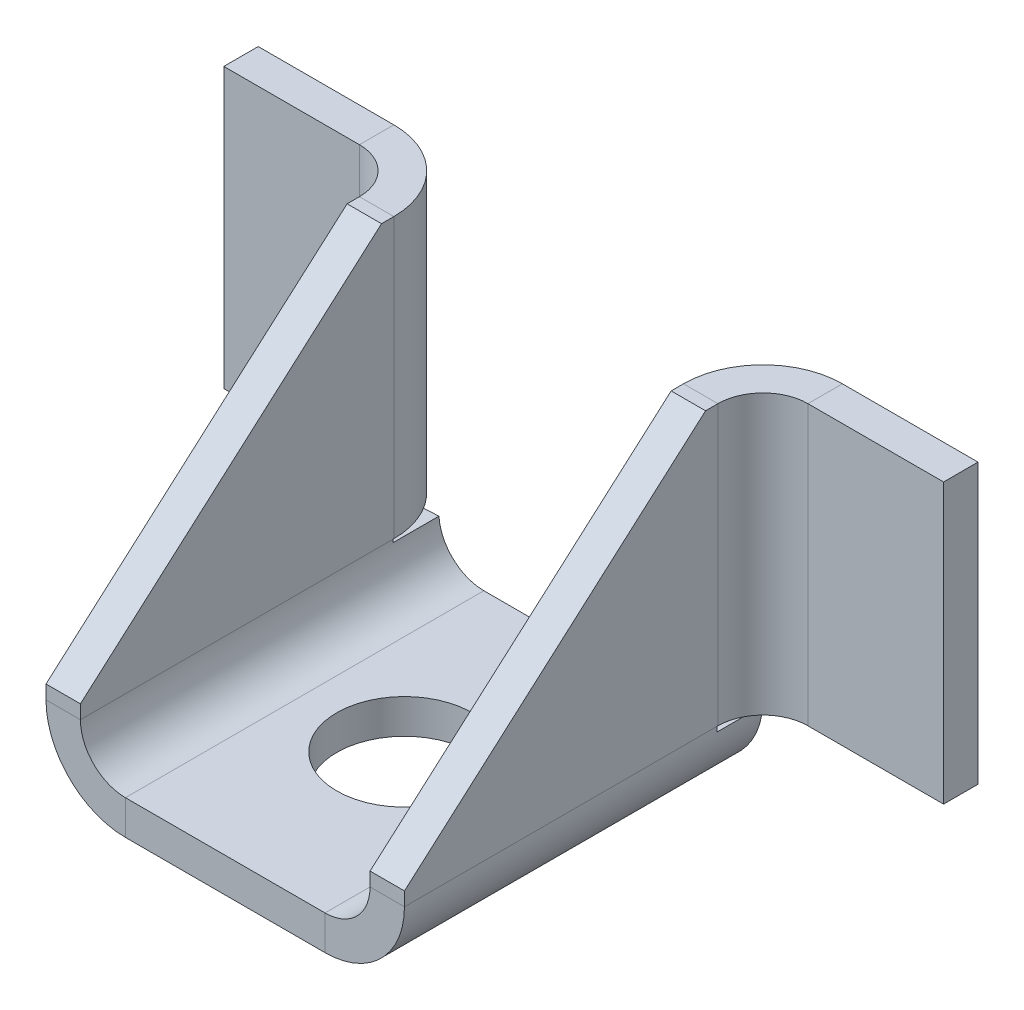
ISO-10303-21;
HEADER;
FILE_DESCRIPTION(('STEP AP214'),'2;1');
FILE_NAME('part.step','',(''),(''),'','','');
FILE_SCHEMA(('AUTOMOTIVE_DESIGN { 1 0 10303 214 1 1 1 1 }'));
ENDSEC;
DATA;
#1=APPLICATION_CONTEXT('core data for automotive mechanical design processes');
#2=APPLICATION_PROTOCOL_DEFINITION('international standard','automotive_design',2000,#1);
#3=PRODUCT_CONTEXT('',#1,'mechanical');
#4=PRODUCT('Part','Part','',(#3));
#5=PRODUCT_RELATED_PRODUCT_CATEGORY('part','',(#4));
#6=PRODUCT_DEFINITION_FORMATION('','',#4);
#7=PRODUCT_DEFINITION_CONTEXT('part definition',#1,'design');
#8=PRODUCT_DEFINITION('design','',#6,#7);
#9=PRODUCT_DEFINITION_SHAPE('','',#8);
#10=(LENGTH_UNIT() NAMED_UNIT(*) SI_UNIT(.MILLI.,.METRE.));
#11=(NAMED_UNIT(*) PLANE_ANGLE_UNIT() SI_UNIT($,.RADIAN.));
#12=(NAMED_UNIT(*) SI_UNIT($,.STERADIAN.) SOLID_ANGLE_UNIT());
#13=UNCERTAINTY_MEASURE_WITH_UNIT(LENGTH_MEASURE(1.E-05),#10,'distance_accuracy_value','');
#14=(GEOMETRIC_REPRESENTATION_CONTEXT(3) GLOBAL_UNCERTAINTY_ASSIGNED_CONTEXT((#13)) GLOBAL_UNIT_ASSIGNED_CONTEXT((#10,
#11,#12)) REPRESENTATION_CONTEXT('',''));
#15=CARTESIAN_POINT('',(0.,0.,0.));
#16=DIRECTION('',(0.,0.,1.));
#17=DIRECTION('',(1.,0.,0.));
#18=AXIS2_PLACEMENT_3D('',#15,#16,#17);
#19=CARTESIAN_POINT('',(-8.83920000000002,3.9878,-15.875));
#20=DIRECTION('',(0.,0.,-1.));
#21=DIRECTION('',(-1.,0.,0.));
#22=AXIS2_PLACEMENT_3D('',#19,#20,#21);
#23=PLANE('',#22);
#24=CARTESIAN_POINT('',(-8.83920000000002,3.9878,-15.875));
#25=DIRECTION('',(0.,0.,1.));
#26=DIRECTION('',(1.,0.,0.));
#27=AXIS2_PLACEMENT_3D('',#24,#25,#26);
#28=CIRCLE('',#27,7.03579999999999);
#29=CARTESIAN_POINT('',(-8.83920000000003,-3.048,-15.875));
#30=VERTEX_POINT('',#29);
#31=CARTESIAN_POINT('',(-15.8607135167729,3.53965987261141,-15.875));
#32=VERTEX_POINT('',#31);
#33=EDGE_CURVE('E324',#30,#32,#28,.F.);
#34=ORIENTED_EDGE('',*,*,#33,.T.);
#35=DIRECTION('',(-0.997969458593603,-0.0636942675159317,0.));
#36=VECTOR('',#35,1.);
#37=CARTESIAN_POINT('',(-15.8607135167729,3.53965987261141,-15.875));
#38=LINE('',#37,#36);
#39=CARTESIAN_POINT('',(-12.8189026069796,3.73379999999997,-15.875));
#40=VERTEX_POINT('',#39);
#41=EDGE_CURVE('E528',#40,#32,#38,.T.);
#42=ORIENTED_EDGE('',*,*,#41,.F.);
#43=CARTESIAN_POINT('',(-8.83920000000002,3.9878,-15.875));
#44=DIRECTION('',(0.,0.,1.));
#45=DIRECTION('',(1.,0.,0.));
#46=AXIS2_PLACEMENT_3D('',#43,#44,#45);
#47=CIRCLE('',#46,3.98779999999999);
#48=CARTESIAN_POINT('',(-8.83920000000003,0.,-15.875));
#49=VERTEX_POINT('',#48);
#50=EDGE_CURVE('E331',#49,#40,#47,.F.);
#51=ORIENTED_EDGE('',*,*,#50,.F.);
#52=DIRECTION('',(0.,-1.,0.));
#53=VECTOR('',#52,1.);
#54=CARTESIAN_POINT('',(-8.83920000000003,0.,-15.875));
#55=LINE('',#54,#53);
#56=EDGE_CURVE('E339',#49,#30,#55,.T.);
#57=ORIENTED_EDGE('',*,*,#56,.T.);
#58=EDGE_LOOP('',(#34,#42,#51,#57));
#59=FACE_BOUND('',#58,.T.);
#60=ADVANCED_FACE('F77',(#59),#23,.T.);
#61=CARTESIAN_POINT('',(-8.83920000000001,3.98780000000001,15.875));
#62=DIRECTION('',(0.,0.,1.));
#63=DIRECTION('',(-1.,0.,0.));
#64=AXIS2_PLACEMENT_3D('',#61,#62,#63);
#65=CYLINDRICAL_SURFACE('',#64,7.03579999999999);
#66=CARTESIAN_POINT('',(-8.83920000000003,3.98780000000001,-11.811));
#67=DIRECTION('',(0.,0.,1.));
#68=DIRECTION('',(1.,0.,0.));
#69=AXIS2_PLACEMENT_3D('',#66,#67,#68);
#70=CIRCLE('',#69,7.0358);
#71=CARTESIAN_POINT('',(-15.875,3.98780000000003,-11.811));
#72=VERTEX_POINT('',#71);
#73=CARTESIAN_POINT('',(-15.8607135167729,3.53965987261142,-11.811));
#74=VERTEX_POINT('',#73);
#75=EDGE_CURVE('E532',#72,#74,#70,.T.);
#76=ORIENTED_EDGE('',*,*,#75,.T.);
#77=DIRECTION('',(0.,0.,-1.));
#78=VECTOR('',#77,1.);
#79=CARTESIAN_POINT('',(-15.8607135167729,3.53965987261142,-11.811));
#80=LINE('',#79,#78);
#81=EDGE_CURVE('E525',#74,#32,#80,.T.);
#82=ORIENTED_EDGE('',*,*,#81,.T.);
#83=ORIENTED_EDGE('',*,*,#33,.F.);
#84=DIRECTION('',(0.,0.,1.));
#85=VECTOR('',#84,1.);
#86=CARTESIAN_POINT('',(-8.83920000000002,-3.04799999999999,15.875));
#87=LINE('',#86,#85);
#88=CARTESIAN_POINT('',(-8.83920000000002,-3.04799999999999,15.875));
#89=VERTEX_POINT('',#88);
#90=EDGE_CURVE('E321',#89,#30,#87,.F.);
#91=ORIENTED_EDGE('',*,*,#90,.F.);
#92=CARTESIAN_POINT('',(-8.83920000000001,3.98780000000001,15.875));
#93=DIRECTION('',(0.,0.,1.));
#94=DIRECTION('',(1.,0.,0.));
#95=AXIS2_PLACEMENT_3D('',#92,#93,#94);
#96=CIRCLE('',#95,7.03579999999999);
#97=CARTESIAN_POINT('',(-15.875,3.98779999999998,15.875));
#98=VERTEX_POINT('',#97);
#99=EDGE_CURVE('E325',#98,#89,#96,.T.);
#100=ORIENTED_EDGE('',*,*,#99,.F.);
#101=DIRECTION('',(0.,0.,1.));
#102=VECTOR('',#101,1.);
#103=CARTESIAN_POINT('',(-15.875,3.98779999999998,-15.875));
#104=LINE('',#103,#102);
#105=EDGE_CURVE('E313',#98,#72,#104,.F.);
#106=ORIENTED_EDGE('',*,*,#105,.T.);
#107=EDGE_LOOP('',(#76,#82,#83,#91,#100,#106));
#108=FACE_BOUND('',#107,.T.);
#109=ADVANCED_FACE('F570',(#108),#65,.T.);
#110=CARTESIAN_POINT('',(-8.83920000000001,3.98780000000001,15.875));
#111=DIRECTION('',(0.,0.,1.));
#112=DIRECTION('',(-1.,0.,0.));
#113=AXIS2_PLACEMENT_3D('',#110,#111,#112);
#114=CYLINDRICAL_SURFACE('',#113,3.98779999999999);
#115=DIRECTION('',(0.,0.,-1.));
#116=VECTOR('',#115,1.);
#117=CARTESIAN_POINT('',(-12.8189026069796,3.73379999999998,32.9882461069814));
#118=LINE('',#117,#116);
#119=CARTESIAN_POINT('',(-12.8189026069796,3.73379999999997,-11.811));
#120=VERTEX_POINT('',#119);
#121=EDGE_CURVE('E530',#120,#40,#118,.T.);
#122=ORIENTED_EDGE('',*,*,#121,.F.);
#123=CARTESIAN_POINT('',(-8.83920000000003,3.98780000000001,-11.811));
#124=DIRECTION('',(0.,0.,-1.));
#125=DIRECTION('',(-1.,0.,0.));
#126=AXIS2_PLACEMENT_3D('',#123,#124,#125);
#127=CIRCLE('',#126,3.9878);
#128=CARTESIAN_POINT('',(-12.827,3.98780000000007,-11.811));
#129=VERTEX_POINT('',#128);
#130=EDGE_CURVE('E537',#129,#120,#127,.F.);
#131=ORIENTED_EDGE('',*,*,#130,.F.);
#132=DIRECTION('',(0.,0.,1.));
#133=VECTOR('',#132,1.);
#134=CARTESIAN_POINT('',(-12.827,3.98779999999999,-15.875));
#135=LINE('',#134,#133);
#136=CARTESIAN_POINT('',(-12.827,3.98779999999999,15.875));
#137=VERTEX_POINT('',#136);
#138=EDGE_CURVE('E299',#129,#137,#135,.T.);
#139=ORIENTED_EDGE('',*,*,#138,.T.);
#140=CARTESIAN_POINT('',(-8.83920000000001,3.98780000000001,15.875));
#141=DIRECTION('',(0.,0.,1.));
#142=DIRECTION('',(1.,0.,0.));
#143=AXIS2_PLACEMENT_3D('',#140,#141,#142);
#144=CIRCLE('',#143,3.98779999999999);
#145=CARTESIAN_POINT('',(-8.83920000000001,0.,15.875));
#146=VERTEX_POINT('',#145);
#147=EDGE_CURVE('E304',#137,#146,#144,.T.);
#148=ORIENTED_EDGE('',*,*,#147,.T.);
#149=DIRECTION('',(0.,0.,1.));
#150=VECTOR('',#149,1.);
#151=CARTESIAN_POINT('',(-8.83920000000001,0.,15.875));
#152=LINE('',#151,#150);
#153=EDGE_CURVE('E334',#146,#49,#152,.F.);
#154=ORIENTED_EDGE('',*,*,#153,.T.);
#155=ORIENTED_EDGE('',*,*,#50,.T.);
#156=EDGE_LOOP('',(#122,#131,#139,#148,#154,#155));
#157=FACE_BOUND('',#156,.T.);
#158=ADVANCED_FACE('F566',(#157),#114,.F.);
#159=CARTESIAN_POINT('',(8.83920000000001,3.9878,-15.875));
#160=DIRECTION('',(0.,0.,1.));
#161=DIRECTION('',(1.,0.,0.));
#162=AXIS2_PLACEMENT_3D('',#159,#160,#161);
#163=PLANE('',#162);
#164=CARTESIAN_POINT('',(8.83920000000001,3.9878,-15.875));
#165=DIRECTION('',(0.,0.,-1.));
#166=DIRECTION('',(-1.,0.,0.));
#167=AXIS2_PLACEMENT_3D('',#164,#165,#166);
#168=CIRCLE('',#167,3.9878);
#169=CARTESIAN_POINT('',(12.8189026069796,3.73379999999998,-15.875));
#170=VERTEX_POINT('',#169);
#171=CARTESIAN_POINT('',(8.83920000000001,0.,-15.875));
#172=VERTEX_POINT('',#171);
#173=EDGE_CURVE('E275',#170,#172,#168,.T.);
#174=ORIENTED_EDGE('',*,*,#173,.F.);
#175=DIRECTION('',(0.997969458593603,-0.0636942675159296,0.));
#176=VECTOR('',#175,1.);
#177=CARTESIAN_POINT('',(15.8607135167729,3.53965987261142,-15.875));
#178=LINE('',#177,#176);
#179=CARTESIAN_POINT('',(15.8607135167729,3.53965987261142,-15.875));
#180=VERTEX_POINT('',#179);
#181=EDGE_CURVE('E261',#170,#180,#178,.T.);
#182=ORIENTED_EDGE('',*,*,#181,.T.);
#183=CARTESIAN_POINT('',(8.83920000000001,3.9878,-15.875));
#184=DIRECTION('',(0.,0.,-1.));
#185=DIRECTION('',(-1.,0.,0.));
#186=AXIS2_PLACEMENT_3D('',#183,#184,#185);
#187=CIRCLE('',#186,7.0358);
#188=CARTESIAN_POINT('',(8.83920000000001,-3.048,-15.875));
#189=VERTEX_POINT('',#188);
#190=EDGE_CURVE('E381',#180,#189,#187,.T.);
#191=ORIENTED_EDGE('',*,*,#190,.T.);
#192=DIRECTION('',(0.,-1.,0.));
#193=VECTOR('',#192,1.);
#194=CARTESIAN_POINT('',(8.83920000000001,0.,-15.875));
#195=LINE('',#194,#193);
#196=EDGE_CURVE('E284',#172,#189,#195,.T.);
#197=ORIENTED_EDGE('',*,*,#196,.F.);
#198=EDGE_LOOP('',(#174,#182,#191,#197));
#199=FACE_BOUND('',#198,.T.);
#200=ADVANCED_FACE('F282',(#199),#163,.F.);
#201=CARTESIAN_POINT('',(8.83920000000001,3.9878,-15.875));
#202=DIRECTION('',(0.,0.,-1.));
#203=DIRECTION('',(1.,0.,0.));
#204=AXIS2_PLACEMENT_3D('',#201,#202,#203);
#205=CYLINDRICAL_SURFACE('',#204,7.0358);
#206=DIRECTION('',(0.,0.,1.));
#207=VECTOR('',#206,1.);
#208=CARTESIAN_POINT('',(15.8607135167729,3.53965987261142,-15.875));
#209=LINE('',#208,#207);
#210=CARTESIAN_POINT('',(15.8607135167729,3.53965987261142,-11.811));
#211=VERTEX_POINT('',#210);
#212=EDGE_CURVE('E267',#180,#211,#209,.T.);
#213=ORIENTED_EDGE('',*,*,#212,.T.);
#214=CARTESIAN_POINT('',(8.83920000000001,3.9878,-11.811));
#215=DIRECTION('',(0.,0.,1.));
#216=DIRECTION('',(1.,0.,0.));
#217=AXIS2_PLACEMENT_3D('',#214,#215,#216);
#218=CIRCLE('',#217,7.0358);
#219=CARTESIAN_POINT('',(15.875,3.9878,-11.811));
#220=VERTEX_POINT('',#219);
#221=EDGE_CURVE('E545',#211,#220,#218,.T.);
#222=ORIENTED_EDGE('',*,*,#221,.T.);
#223=DIRECTION('',(0.,0.,-1.));
#224=VECTOR('',#223,1.);
#225=CARTESIAN_POINT('',(15.875,3.98779999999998,15.875));
#226=LINE('',#225,#224);
#227=CARTESIAN_POINT('',(15.875,3.98779999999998,15.875));
#228=VERTEX_POINT('',#227);
#229=EDGE_CURVE('E398',#220,#228,#226,.F.);
#230=ORIENTED_EDGE('',*,*,#229,.T.);
#231=CARTESIAN_POINT('',(8.83920000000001,3.9878,15.875));
#232=DIRECTION('',(0.,0.,-1.));
#233=DIRECTION('',(-1.,0.,0.));
#234=AXIS2_PLACEMENT_3D('',#231,#232,#233);
#235=CIRCLE('',#234,7.0358);
#236=CARTESIAN_POINT('',(8.83920000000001,-3.048,15.875));
#237=VERTEX_POINT('',#236);
#238=EDGE_CURVE('E301',#237,#228,#235,.F.);
#239=ORIENTED_EDGE('',*,*,#238,.F.);
#240=DIRECTION('',(0.,0.,-1.));
#241=VECTOR('',#240,1.);
#242=CARTESIAN_POINT('',(8.83920000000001,-3.048,-15.875));
#243=LINE('',#242,#241);
#244=EDGE_CURVE('E378',#189,#237,#243,.F.);
#245=ORIENTED_EDGE('',*,*,#244,.F.);
#246=ORIENTED_EDGE('',*,*,#190,.F.);
#247=EDGE_LOOP('',(#213,#222,#230,#239,#245,#246));
#248=FACE_BOUND('',#247,.T.);
#249=ADVANCED_FACE('F557',(#248),#205,.T.);
#250=CARTESIAN_POINT('',(8.83920000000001,3.9878,-15.875));
#251=DIRECTION('',(0.,0.,-1.));
#252=DIRECTION('',(1.,0.,0.));
#253=AXIS2_PLACEMENT_3D('',#250,#251,#252);
#254=CYLINDRICAL_SURFACE('',#253,3.9878);
#255=CARTESIAN_POINT('',(8.83920000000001,3.9878,-11.811));
#256=DIRECTION('',(0.,0.,1.));
#257=DIRECTION('',(1.,0.,0.));
#258=AXIS2_PLACEMENT_3D('',#255,#256,#257);
#259=CIRCLE('',#258,3.9878);
#260=CARTESIAN_POINT('',(12.8189026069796,3.73379999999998,-11.811));
#261=VERTEX_POINT('',#260);
#262=CARTESIAN_POINT('',(12.827,3.98780000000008,-11.811));
#263=VERTEX_POINT('',#262);
#264=EDGE_CURVE('E279',#261,#263,#259,.T.);
#265=ORIENTED_EDGE('',*,*,#264,.F.);
#266=DIRECTION('',(0.,0.,1.));
#267=VECTOR('',#266,1.);
#268=CARTESIAN_POINT('',(12.8189026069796,3.73379999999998,-32.9882461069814));
#269=LINE('',#268,#267);
#270=EDGE_CURVE('E264',#170,#261,#269,.T.);
#271=ORIENTED_EDGE('',*,*,#270,.F.);
#272=ORIENTED_EDGE('',*,*,#173,.T.);
#273=DIRECTION('',(0.,0.,-1.));
#274=VECTOR('',#273,1.);
#275=CARTESIAN_POINT('',(8.83920000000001,0.,-15.875));
#276=LINE('',#275,#274);
#277=CARTESIAN_POINT('',(8.83920000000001,0.,15.875));
#278=VERTEX_POINT('',#277);
#279=EDGE_CURVE('E286',#172,#278,#276,.F.);
#280=ORIENTED_EDGE('',*,*,#279,.T.);
#281=CARTESIAN_POINT('',(8.83920000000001,3.9878,15.875));
#282=DIRECTION('',(0.,0.,-1.));
#283=DIRECTION('',(-1.,0.,0.));
#284=AXIS2_PLACEMENT_3D('',#281,#282,#283);
#285=CIRCLE('',#284,3.9878);
#286=CARTESIAN_POINT('',(12.827,3.98779999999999,15.875));
#287=VERTEX_POINT('',#286);
#288=EDGE_CURVE('E289',#278,#287,#285,.F.);
#289=ORIENTED_EDGE('',*,*,#288,.T.);
#290=DIRECTION('',(0.,0.,-1.));
#291=VECTOR('',#290,1.);
#292=CARTESIAN_POINT('',(12.827,3.98779999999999,15.875));
#293=LINE('',#292,#291);
#294=EDGE_CURVE('E389',#287,#263,#293,.T.);
#295=ORIENTED_EDGE('',*,*,#294,.T.);
#296=EDGE_LOOP('',(#265,#271,#272,#280,#289,#295));
#297=FACE_BOUND('',#296,.T.);
#298=ADVANCED_FACE('F274',(#297),#254,.F.);
#299=CARTESIAN_POINT('',(15.875,0.,0.));
#300=DIRECTION('',(-1.,0.,0.));
#301=DIRECTION('',(0.,-1.,0.));
#302=AXIS2_PLACEMENT_3D('',#299,#300,#301);
#303=PLANE('',#302);
#304=DIRECTION('',(0.,0.,1.));
#305=VECTOR('',#304,1.);
#306=CARTESIAN_POINT('',(15.8750000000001,28.702,0.));
#307=LINE('',#306,#305);
#308=CARTESIAN_POINT('',(15.8750000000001,28.702,-11.8872));
#309=VERTEX_POINT('',#308);
#310=CARTESIAN_POINT('',(15.8750000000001,28.702,-10.795));
#311=VERTEX_POINT('',#310);
#312=EDGE_CURVE('E287',#309,#311,#307,.T.);
#313=ORIENTED_EDGE('',*,*,#312,.T.);
#314=DIRECTION('',(0.,-0.661030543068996,0.750358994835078));
#315=VECTOR('',#314,1.);
#316=CARTESIAN_POINT('',(15.875,10.8059042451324,9.51948707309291));
#317=LINE('',#316,#315);
#318=CARTESIAN_POINT('',(15.8750000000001,5.207,15.875));
#319=VERTEX_POINT('',#318);
#320=EDGE_CURVE('E504',#311,#319,#317,.T.);
#321=ORIENTED_EDGE('',*,*,#320,.T.);
#322=DIRECTION('',(0.,-1.,0.));
#323=VECTOR('',#322,1.);
#324=CARTESIAN_POINT('',(15.875,0.,15.875));
#325=LINE('',#324,#323);
#326=EDGE_CURVE('E292',#319,#228,#325,.T.);
#327=ORIENTED_EDGE('',*,*,#326,.T.);
#328=ORIENTED_EDGE('',*,*,#229,.F.);
#329=CARTESIAN_POINT('',(15.875,3.98780000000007,-11.8872));
#330=VERTEX_POINT('',#329);
#331=EDGE_CURVE('E399',#330,#220,#226,.F.);
#332=ORIENTED_EDGE('',*,*,#331,.F.);
#333=DIRECTION('',(0.,1.,0.));
#334=VECTOR('',#333,1.);
#335=CARTESIAN_POINT('',(15.8750000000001,28.702,-11.8872));
#336=LINE('',#335,#334);
#337=EDGE_CURVE('E464',#309,#330,#336,.F.);
#338=ORIENTED_EDGE('',*,*,#337,.F.);
#339=EDGE_LOOP('',(#313,#321,#327,#328,#332,#338));
#340=FACE_BOUND('',#339,.T.);
#341=ADVANCED_FACE('F564',(#340),#303,.F.);
#342=CARTESIAN_POINT('',(12.827,0.,0.));
#343=DIRECTION('',(-1.,0.,0.));
#344=DIRECTION('',(0.,-1.,0.));
#345=AXIS2_PLACEMENT_3D('',#342,#343,#344);
#346=PLANE('',#345);
#347=DIRECTION('',(0.,-0.661030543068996,0.750358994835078));
#348=VECTOR('',#347,1.);
#349=CARTESIAN_POINT('',(12.827,10.8059042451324,9.5194870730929));
#350=LINE('',#349,#348);
#351=CARTESIAN_POINT('',(12.8270000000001,28.702,-10.795));
#352=VERTEX_POINT('',#351);
#353=CARTESIAN_POINT('',(12.827,5.207,15.875));
#354=VERTEX_POINT('',#353);
#355=EDGE_CURVE('E100',#352,#354,#350,.T.);
#356=ORIENTED_EDGE('',*,*,#355,.F.);
#357=DIRECTION('',(0.,0.,-1.));
#358=VECTOR('',#357,1.);
#359=CARTESIAN_POINT('',(12.8270000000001,28.702,15.875));
#360=LINE('',#359,#358);
#361=CARTESIAN_POINT('',(12.8270000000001,28.702,-11.8872));
#362=VERTEX_POINT('',#361);
#363=EDGE_CURVE('E404',#362,#352,#360,.F.);
#364=ORIENTED_EDGE('',*,*,#363,.F.);
#365=DIRECTION('',(0.,1.,0.));
#366=VECTOR('',#365,1.);
#367=CARTESIAN_POINT('',(12.8270000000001,28.702,-11.8872));
#368=LINE('',#367,#366);
#369=CARTESIAN_POINT('',(12.827,3.98780000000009,-11.8872));
#370=VERTEX_POINT('',#369);
#371=EDGE_CURVE('E474',#362,#370,#368,.F.);
#372=ORIENTED_EDGE('',*,*,#371,.T.);
#373=DIRECTION('',(0.,0.,-1.));
#374=VECTOR('',#373,1.);
#375=CARTESIAN_POINT('',(12.827,3.98780000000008,-15.875));
#376=LINE('',#375,#374);
#377=EDGE_CURVE('E397',#370,#263,#376,.F.);
#378=ORIENTED_EDGE('',*,*,#377,.T.);
#379=ORIENTED_EDGE('',*,*,#294,.F.);
#380=DIRECTION('',(0.,1.,0.));
#381=VECTOR('',#380,1.);
#382=CARTESIAN_POINT('',(12.827,0.,15.875));
#383=LINE('',#382,#381);
#384=EDGE_CURVE('E394',#354,#287,#383,.F.);
#385=ORIENTED_EDGE('',*,*,#384,.F.);
#386=EDGE_LOOP('',(#356,#364,#372,#378,#379,#385));
#387=FACE_BOUND('',#386,.T.);
#388=ADVANCED_FACE('F393',(#387),#346,.T.);
#389=CARTESIAN_POINT('',(15.8750000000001,28.702,15.875));
#390=DIRECTION('',(0.,-1.,0.));
#391=DIRECTION('',(1.,0.,0.));
#392=AXIS2_PLACEMENT_3D('',#389,#390,#391);
#393=PLANE('',#392);
#394=ORIENTED_EDGE('',*,*,#363,.T.);
#395=DIRECTION('',(1.,0.,0.));
#396=VECTOR('',#395,1.);
#397=CARTESIAN_POINT('',(-31.8770000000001,28.702,-10.795));
#398=LINE('',#397,#396);
#399=EDGE_CURVE('E517',#352,#311,#398,.T.);
#400=ORIENTED_EDGE('',*,*,#399,.T.);
#401=ORIENTED_EDGE('',*,*,#312,.F.);
#402=DIRECTION('',(-1.,0.,0.));
#403=VECTOR('',#402,1.);
#404=CARTESIAN_POINT('',(15.8750000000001,28.702,-11.8872));
#405=LINE('',#404,#403);
#406=EDGE_CURVE('E454',#309,#362,#405,.T.);
#407=ORIENTED_EDGE('',*,*,#406,.T.);
#408=EDGE_LOOP('',(#394,#400,#401,#407));
#409=FACE_BOUND('',#408,.T.);
#410=ADVANCED_FACE('F696',(#409),#393,.F.);
#411=CARTESIAN_POINT('',(-15.875,0.,0.));
#412=DIRECTION('',(1.,0.,0.));
#413=DIRECTION('',(0.,1.,0.));
#414=AXIS2_PLACEMENT_3D('',#411,#412,#413);
#415=PLANE('',#414);
#416=DIRECTION('',(0.,1.,0.));
#417=VECTOR('',#416,1.);
#418=CARTESIAN_POINT('',(-15.875,0.,15.875));
#419=LINE('',#418,#417);
#420=CARTESIAN_POINT('',(-15.875,5.207,15.875));
#421=VERTEX_POINT('',#420);
#422=EDGE_CURVE('E305',#98,#421,#419,.T.);
#423=ORIENTED_EDGE('',*,*,#422,.T.);
#424=DIRECTION('',(0.,0.661030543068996,-0.750358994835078));
#425=VECTOR('',#424,1.);
#426=CARTESIAN_POINT('',(-15.875,10.8059042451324,9.51948707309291));
#427=LINE('',#426,#425);
#428=CARTESIAN_POINT('',(-15.8750000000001,28.702,-10.795));
#429=VERTEX_POINT('',#428);
#430=EDGE_CURVE('E92',#421,#429,#427,.T.);
#431=ORIENTED_EDGE('',*,*,#430,.T.);
#432=DIRECTION('',(0.,0.,-1.));
#433=VECTOR('',#432,1.);
#434=CARTESIAN_POINT('',(-15.8750000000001,28.702,0.));
#435=LINE('',#434,#433);
#436=CARTESIAN_POINT('',(-15.8750000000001,28.702,-11.8872));
#437=VERTEX_POINT('',#436);
#438=EDGE_CURVE('E302',#429,#437,#435,.T.);
#439=ORIENTED_EDGE('',*,*,#438,.T.);
#440=DIRECTION('',(0.,-1.,0.));
#441=VECTOR('',#440,1.);
#442=CARTESIAN_POINT('',(-15.875,3.98779999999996,-11.8872));
#443=LINE('',#442,#441);
#444=CARTESIAN_POINT('',(-15.875,3.98780000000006,-11.8872));
#445=VERTEX_POINT('',#444);
#446=EDGE_CURVE('E415',#445,#437,#443,.F.);
#447=ORIENTED_EDGE('',*,*,#446,.F.);
#448=DIRECTION('',(0.,0.,1.));
#449=VECTOR('',#448,1.);
#450=CARTESIAN_POINT('',(-15.875,3.98780000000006,15.875));
#451=LINE('',#450,#449);
#452=EDGE_CURVE('E271',#72,#445,#451,.F.);
#453=ORIENTED_EDGE('',*,*,#452,.F.);
#454=ORIENTED_EDGE('',*,*,#105,.F.);
#455=EDGE_LOOP('',(#423,#431,#439,#447,#453,#454));
#456=FACE_BOUND('',#455,.T.);
#457=ADVANCED_FACE('F620',(#456),#415,.F.);
#458=CARTESIAN_POINT('',(-12.827,0.,0.));
#459=DIRECTION('',(1.,0.,0.));
#460=DIRECTION('',(0.,1.,0.));
#461=AXIS2_PLACEMENT_3D('',#458,#459,#460);
#462=PLANE('',#461);
#463=DIRECTION('',(0.,0.661030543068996,-0.750358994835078));
#464=VECTOR('',#463,1.);
#465=CARTESIAN_POINT('',(-12.827,10.8059042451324,9.5194870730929));
#466=LINE('',#465,#464);
#467=CARTESIAN_POINT('',(-12.827,5.207,15.875));
#468=VERTEX_POINT('',#467);
#469=CARTESIAN_POINT('',(-12.8270000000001,28.702,-10.795));
#470=VERTEX_POINT('',#469);
#471=EDGE_CURVE('E512',#468,#470,#466,.T.);
#472=ORIENTED_EDGE('',*,*,#471,.F.);
#473=DIRECTION('',(0.,-1.,0.));
#474=VECTOR('',#473,1.);
#475=CARTESIAN_POINT('',(-12.8270000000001,28.702,15.875));
#476=LINE('',#475,#474);
#477=EDGE_CURVE('E310',#137,#468,#476,.F.);
#478=ORIENTED_EDGE('',*,*,#477,.F.);
#479=ORIENTED_EDGE('',*,*,#138,.F.);
#480=CARTESIAN_POINT('',(-12.827,3.98780000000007,-11.8872));
#481=VERTEX_POINT('',#480);
#482=EDGE_CURVE('E319',#481,#129,#135,.T.);
#483=ORIENTED_EDGE('',*,*,#482,.F.);
#484=DIRECTION('',(0.,-1.,0.));
#485=VECTOR('',#484,1.);
#486=CARTESIAN_POINT('',(-12.827,3.98779999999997,-11.8872));
#487=LINE('',#486,#485);
#488=CARTESIAN_POINT('',(-12.8270000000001,28.702,-11.8872));
#489=VERTEX_POINT('',#488);
#490=EDGE_CURVE('E422',#481,#489,#487,.F.);
#491=ORIENTED_EDGE('',*,*,#490,.T.);
#492=DIRECTION('',(0.,0.,1.));
#493=VECTOR('',#492,1.);
#494=CARTESIAN_POINT('',(-12.8270000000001,28.702,-15.875));
#495=LINE('',#494,#493);
#496=EDGE_CURVE('E308',#470,#489,#495,.F.);
#497=ORIENTED_EDGE('',*,*,#496,.F.);
#498=EDGE_LOOP('',(#472,#478,#479,#483,#491,#497));
#499=FACE_BOUND('',#498,.T.);
#500=ADVANCED_FACE('F631',(#499),#462,.T.);
#501=CARTESIAN_POINT('',(-15.8750000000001,28.702,-15.875));
#502=DIRECTION('',(0.,-1.,0.));
#503=DIRECTION('',(1.,0.,0.));
#504=AXIS2_PLACEMENT_3D('',#501,#502,#503);
#505=PLANE('',#504);
#506=ORIENTED_EDGE('',*,*,#438,.F.);
#507=EDGE_CURVE('E514',#429,#470,#398,.T.);
#508=ORIENTED_EDGE('',*,*,#507,.T.);
#509=ORIENTED_EDGE('',*,*,#496,.T.);
#510=DIRECTION('',(1.,0.,0.));
#511=VECTOR('',#510,1.);
#512=CARTESIAN_POINT('',(-15.8750000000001,28.702,-11.8872));
#513=LINE('',#512,#511);
#514=EDGE_CURVE('E401',#437,#489,#513,.T.);
#515=ORIENTED_EDGE('',*,*,#514,.F.);
#516=EDGE_LOOP('',(#506,#508,#509,#515));
#517=FACE_BOUND('',#516,.T.);
#518=ADVANCED_FACE('F591',(#517),#505,.F.);
#519=CARTESIAN_POINT('',(0.,-3.048,0.));
#520=DIRECTION('',(0.,-1.,0.));
#521=DIRECTION('',(0.,0.,-1.));
#522=AXIS2_PLACEMENT_3D('',#519,#520,#521);
#523=PLANE('',#522);
#524=CARTESIAN_POINT('',(0.,-3.048,0.));
#525=DIRECTION('',(0.,1.,0.));
#526=DIRECTION('',(0.,0.,1.));
#527=AXIS2_PLACEMENT_3D('',#524,#525,#526);
#528=CIRCLE('',#527,5.999999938);
#529=CARTESIAN_POINT('',(0.,-3.048,5.999999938));
#530=VERTEX_POINT('',#529);
#531=EDGE_CURVE('E345',#530,#530,#528,.T.);
#532=ORIENTED_EDGE('',*,*,#531,.T.);
#533=EDGE_LOOP('',(#532));
#534=FACE_BOUND('',#533,.T.);
#535=DIRECTION('',(-1.,0.,0.));
#536=VECTOR('',#535,1.);
#537=CARTESIAN_POINT('',(15.875,-3.048,-15.875));
#538=LINE('',#537,#536);
#539=EDGE_CURVE('E351',#189,#30,#538,.T.);
#540=ORIENTED_EDGE('',*,*,#539,.F.);
#541=ORIENTED_EDGE('',*,*,#244,.T.);
#542=DIRECTION('',(1.,0.,0.));
#543=VECTOR('',#542,1.);
#544=CARTESIAN_POINT('',(15.875,-3.048,15.875));
#545=LINE('',#544,#543);
#546=EDGE_CURVE('E353',#89,#237,#545,.T.);
#547=ORIENTED_EDGE('',*,*,#546,.F.);
#548=ORIENTED_EDGE('',*,*,#90,.T.);
#549=EDGE_LOOP('',(#540,#541,#547,#548));
#550=FACE_BOUND('',#549,.T.);
#551=ADVANCED_FACE('F379',(#534,#550),#523,.T.);
#552=CARTESIAN_POINT('',(0.,0.,0.));
#553=DIRECTION('',(0.,-1.,0.));
#554=DIRECTION('',(0.,0.,-1.));
#555=AXIS2_PLACEMENT_3D('',#552,#553,#554);
#556=PLANE('',#555);
#557=CARTESIAN_POINT('',(0.,0.,0.));
#558=DIRECTION('',(0.,1.,0.));
#559=DIRECTION('',(0.,0.,1.));
#560=AXIS2_PLACEMENT_3D('',#557,#558,#559);
#561=CIRCLE('',#560,5.999999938);
#562=CARTESIAN_POINT('',(0.,0.,5.999999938));
#563=VERTEX_POINT('',#562);
#564=EDGE_CURVE('E342',#563,#563,#561,.T.);
#565=ORIENTED_EDGE('',*,*,#564,.F.);
#566=EDGE_LOOP('',(#565));
#567=FACE_BOUND('',#566,.T.);
#568=ORIENTED_EDGE('',*,*,#279,.F.);
#569=DIRECTION('',(-1.,0.,0.));
#570=VECTOR('',#569,1.);
#571=CARTESIAN_POINT('',(15.875,0.,-15.875));
#572=LINE('',#571,#570);
#573=EDGE_CURVE('E348',#172,#49,#572,.T.);
#574=ORIENTED_EDGE('',*,*,#573,.T.);
#575=ORIENTED_EDGE('',*,*,#153,.F.);
#576=DIRECTION('',(1.,0.,0.));
#577=VECTOR('',#576,1.);
#578=CARTESIAN_POINT('',(15.875,0.,15.875));
#579=LINE('',#578,#577);
#580=EDGE_CURVE('E354',#146,#278,#579,.T.);
#581=ORIENTED_EDGE('',*,*,#580,.T.);
#582=EDGE_LOOP('',(#568,#574,#575,#581));
#583=FACE_BOUND('',#582,.T.);
#584=ADVANCED_FACE('F361',(#567,#583),#556,.F.);
#585=CARTESIAN_POINT('',(15.875,-3.048,-15.875));
#586=DIRECTION('',(0.,0.,-1.));
#587=DIRECTION('',(-1.,0.,0.));
#588=AXIS2_PLACEMENT_3D('',#585,#586,#587);
#589=PLANE('',#588);
#590=ORIENTED_EDGE('',*,*,#573,.F.);
#591=ORIENTED_EDGE('',*,*,#196,.T.);
#592=ORIENTED_EDGE('',*,*,#539,.T.);
#593=ORIENTED_EDGE('',*,*,#56,.F.);
#594=EDGE_LOOP('',(#590,#591,#592,#593));
#595=FACE_BOUND('',#594,.T.);
#596=ADVANCED_FACE('F79',(#595),#589,.T.);
#597=CARTESIAN_POINT('',(15.875,-3.048,15.875));
#598=DIRECTION('',(0.,0.,1.));
#599=DIRECTION('',(1.,0.,0.));
#600=AXIS2_PLACEMENT_3D('',#597,#598,#599);
#601=PLANE('',#600);
#602=DIRECTION('',(0.,-1.,0.));
#603=VECTOR('',#602,1.);
#604=CARTESIAN_POINT('',(8.83920000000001,0.,15.875));
#605=LINE('',#604,#603);
#606=EDGE_CURVE('E296',#278,#237,#605,.T.);
#607=ORIENTED_EDGE('',*,*,#606,.F.);
#608=ORIENTED_EDGE('',*,*,#580,.F.);
#609=DIRECTION('',(0.,-1.,0.));
#610=VECTOR('',#609,1.);
#611=CARTESIAN_POINT('',(-8.83920000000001,0.,15.875));
#612=LINE('',#611,#610);
#613=EDGE_CURVE('E328',#146,#89,#612,.T.);
#614=ORIENTED_EDGE('',*,*,#613,.T.);
#615=ORIENTED_EDGE('',*,*,#546,.T.);
#616=EDGE_LOOP('',(#607,#608,#614,#615));
#617=FACE_BOUND('',#616,.T.);
#618=ADVANCED_FACE('F365',(#617),#601,.T.);
#619=CARTESIAN_POINT('',(0.,-3.048,0.));
#620=DIRECTION('',(0.,1.,0.));
#621=DIRECTION('',(0.,0.,1.));
#622=AXIS2_PLACEMENT_3D('',#619,#620,#621);
#623=CYLINDRICAL_SURFACE('',#622,5.999999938);
#624=CARTESIAN_POINT('',(0.,-3.048,5.999999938));
#625=CARTESIAN_POINT('',(0.,-3.01625,5.999999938));
#626=CARTESIAN_POINT('',(0.,-2.9845,5.999999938));
#627=CARTESIAN_POINT('',(0.,-2.921,5.999999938));
#628=CARTESIAN_POINT('',(0.,-2.88925,5.999999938));
#629=CARTESIAN_POINT('',(0.,-2.82575,5.999999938));
#630=CARTESIAN_POINT('',(0.,-2.794,5.999999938));
#631=CARTESIAN_POINT('',(0.,-2.7305,5.999999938));
#632=CARTESIAN_POINT('',(0.,-2.69875,5.999999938));
#633=CARTESIAN_POINT('',(0.,-2.63525,5.999999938));
#634=CARTESIAN_POINT('',(0.,-2.6035,5.999999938));
#635=CARTESIAN_POINT('',(0.,-2.54,5.999999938));
#636=CARTESIAN_POINT('',(0.,-2.50825,5.999999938));
#637=CARTESIAN_POINT('',(0.,-2.44475,5.999999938));
#638=CARTESIAN_POINT('',(0.,-2.413,5.999999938));
#639=CARTESIAN_POINT('',(0.,-2.3495,5.999999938));
#640=CARTESIAN_POINT('',(0.,-2.31775,5.999999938));
#641=CARTESIAN_POINT('',(0.,-2.25425,5.999999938));
#642=CARTESIAN_POINT('',(0.,-2.2225,5.999999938));
#643=CARTESIAN_POINT('',(0.,-2.159,5.999999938));
#644=CARTESIAN_POINT('',(0.,-2.12725,5.999999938));
#645=CARTESIAN_POINT('',(0.,-2.06375,5.999999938));
#646=CARTESIAN_POINT('',(0.,-2.032,5.999999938));
#647=CARTESIAN_POINT('',(0.,-1.9685,5.999999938));
#648=CARTESIAN_POINT('',(0.,-1.93675,5.999999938));
#649=CARTESIAN_POINT('',(0.,-1.87325,5.999999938));
#650=CARTESIAN_POINT('',(0.,-1.8415,5.999999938));
#651=CARTESIAN_POINT('',(0.,-1.778,5.999999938));
#652=CARTESIAN_POINT('',(0.,-1.74625,5.999999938));
#653=CARTESIAN_POINT('',(0.,-1.68275,5.999999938));
#654=CARTESIAN_POINT('',(0.,-1.651,5.999999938));
#655=CARTESIAN_POINT('',(0.,-1.5875,5.999999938));
#656=CARTESIAN_POINT('',(0.,-1.55575,5.999999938));
#657=CARTESIAN_POINT('',(0.,-1.49225,5.999999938));
#658=CARTESIAN_POINT('',(0.,-1.4605,5.999999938));
#659=CARTESIAN_POINT('',(0.,-1.397,5.999999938));
#660=CARTESIAN_POINT('',(0.,-1.36525,5.999999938));
#661=CARTESIAN_POINT('',(0.,-1.30175,5.999999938));
#662=CARTESIAN_POINT('',(0.,-1.27,5.999999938));
#663=CARTESIAN_POINT('',(0.,-1.2065,5.999999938));
#664=CARTESIAN_POINT('',(0.,-1.17475,5.999999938));
#665=CARTESIAN_POINT('',(0.,-1.11125,5.999999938));
#666=CARTESIAN_POINT('',(0.,-1.0795,5.999999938));
#667=CARTESIAN_POINT('',(0.,-1.016,5.999999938));
#668=CARTESIAN_POINT('',(0.,-0.98425,5.999999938));
#669=CARTESIAN_POINT('',(0.,-0.92075,5.999999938));
#670=CARTESIAN_POINT('',(0.,-0.889,5.999999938));
#671=CARTESIAN_POINT('',(0.,-0.8255,5.999999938));
#672=CARTESIAN_POINT('',(0.,-0.79375,5.999999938));
#673=CARTESIAN_POINT('',(0.,-0.73025,5.999999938));
#674=CARTESIAN_POINT('',(0.,-0.6985,5.999999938));
#675=CARTESIAN_POINT('',(0.,-0.635,5.999999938));
#676=CARTESIAN_POINT('',(0.,-0.60325,5.999999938));
#677=CARTESIAN_POINT('',(0.,-0.53975,5.999999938));
#678=CARTESIAN_POINT('',(0.,-0.508,5.999999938));
#679=CARTESIAN_POINT('',(0.,-0.4445,5.999999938));
#680=CARTESIAN_POINT('',(0.,-0.41275,5.999999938));
#681=CARTESIAN_POINT('',(0.,-0.34925,5.999999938));
#682=CARTESIAN_POINT('',(0.,-0.3175,5.999999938));
#683=CARTESIAN_POINT('',(0.,-0.254,5.999999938));
#684=CARTESIAN_POINT('',(0.,-0.22225,5.999999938));
#685=CARTESIAN_POINT('',(0.,-0.15875,5.999999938));
#686=CARTESIAN_POINT('',(0.,-0.127,5.999999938));
#687=CARTESIAN_POINT('',(0.,-0.0634999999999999,5.999999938));
#688=CARTESIAN_POINT('',(0.,-0.03175,5.999999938));
#689=CARTESIAN_POINT('',(0.,0.,5.999999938));
#690=B_SPLINE_CURVE_WITH_KNOTS('',3,(#624,#625,#626,#627,#628,#629,#630,#631,#632,#633,#634,
#635,#636,#637,#638,#639,#640,#641,#642,#643,#644,#645,#646,#647,#648,#649,#650,#651,#652,#653,
#654,#655,#656,#657,#658,#659,#660,#661,#662,#663,#664,#665,#666,#667,#668,#669,#670,#671,#672,
#673,#674,#675,#676,#677,#678,#679,#680,#681,#682,#683,#684,#685,#686,#687,#688,#689),
.UNSPECIFIED.,.F.,.F.,(4,2,2,2,2,2,2,2,2,2,2,2,2,2,2,2,2,2,2,2,2,2,2,2,2,2,2,2,2,2,2,2,4),(0.,
0.0952499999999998,0.1905,0.28575,0.381,0.47625,0.5715,0.66675,0.762,0.85725,0.9525,1.04775,
1.143,1.23825,1.3335,1.42875,1.524,1.61925,1.7145,1.80975,1.905,2.00025,2.0955,2.19075,2.286,
2.38125,2.4765,2.57175,2.667,2.76225,2.8575,2.95275,3.048),.UNSPECIFIED.);
#691=EDGE_CURVE('BSEAM584',#530,#563,#690,.T.);
#692=ORIENTED_EDGE('',*,*,#531,.F.);
#693=ORIENTED_EDGE('',*,*,#564,.T.);
#694=ORIENTED_EDGE('',*,*,#691,.T.);
#695=ORIENTED_EDGE('',*,*,#691,.F.);
#696=EDGE_LOOP('',(#692,#694,#693,#695));
#697=FACE_BOUND('',#696,.T.);
#698=ADVANCED_FACE('F584',(#697),#623,.F.);
#699=CARTESIAN_POINT('',(-8.83920000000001,3.98780000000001,15.875));
#700=DIRECTION('',(0.,0.,-1.));
#701=DIRECTION('',(-1.,0.,0.));
#702=AXIS2_PLACEMENT_3D('',#699,#700,#701);
#703=PLANE('',#702);
#704=ORIENTED_EDGE('',*,*,#147,.F.);
#705=DIRECTION('',(1.,0.,0.));
#706=VECTOR('',#705,1.);
#707=CARTESIAN_POINT('',(-12.827,3.98779999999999,15.875));
#708=LINE('',#707,#706);
#709=EDGE_CURVE('E316',#137,#98,#708,.F.);
#710=ORIENTED_EDGE('',*,*,#709,.T.);
#711=ORIENTED_EDGE('',*,*,#99,.T.);
#712=ORIENTED_EDGE('',*,*,#613,.F.);
#713=EDGE_LOOP('',(#704,#710,#711,#712));
#714=FACE_BOUND('',#713,.T.);
#715=ADVANCED_FACE('F580',(#714),#703,.F.);
#716=CARTESIAN_POINT('',(-15.8750000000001,28.702,15.875));
#717=DIRECTION('',(0.,0.,-1.));
#718=DIRECTION('',(-1.,0.,0.));
#719=AXIS2_PLACEMENT_3D('',#716,#717,#718);
#720=PLANE('',#719);
#721=ORIENTED_EDGE('',*,*,#477,.T.);
#722=DIRECTION('',(1.,0.,0.));
#723=VECTOR('',#722,1.);
#724=CARTESIAN_POINT('',(-31.8770000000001,5.207,15.875));
#725=LINE('',#724,#723);
#726=EDGE_CURVE('E515',#421,#468,#725,.T.);
#727=ORIENTED_EDGE('',*,*,#726,.F.);
#728=ORIENTED_EDGE('',*,*,#422,.F.);
#729=ORIENTED_EDGE('',*,*,#709,.F.);
#730=EDGE_LOOP('',(#721,#727,#728,#729));
#731=FACE_BOUND('',#730,.T.);
#732=ADVANCED_FACE('F583',(#731),#720,.F.);
#733=CARTESIAN_POINT('',(8.83920000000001,3.9878,15.875));
#734=DIRECTION('',(0.,0.,1.));
#735=DIRECTION('',(1.,0.,0.));
#736=AXIS2_PLACEMENT_3D('',#733,#734,#735);
#737=PLANE('',#736);
#738=DIRECTION('',(-1.,0.,0.));
#739=VECTOR('',#738,1.);
#740=CARTESIAN_POINT('',(15.875,3.98779999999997,15.875));
#741=LINE('',#740,#739);
#742=EDGE_CURVE('E386',#287,#228,#741,.F.);
#743=ORIENTED_EDGE('',*,*,#742,.F.);
#744=ORIENTED_EDGE('',*,*,#288,.F.);
#745=ORIENTED_EDGE('',*,*,#606,.T.);
#746=ORIENTED_EDGE('',*,*,#238,.T.);
#747=EDGE_LOOP('',(#743,#744,#745,#746));
#748=FACE_BOUND('',#747,.T.);
#749=ADVANCED_FACE('F372',(#748),#737,.T.);
#750=CARTESIAN_POINT('',(15.875,0.,15.875));
#751=DIRECTION('',(0.,0.,-1.));
#752=DIRECTION('',(-1.,0.,0.));
#753=AXIS2_PLACEMENT_3D('',#750,#751,#752);
#754=PLANE('',#753);
#755=ORIENTED_EDGE('',*,*,#326,.F.);
#756=DIRECTION('',(-1.,0.,0.));
#757=VECTOR('',#756,1.);
#758=CARTESIAN_POINT('',(15.875,5.207,15.875));
#759=LINE('',#758,#757);
#760=EDGE_CURVE('E13',#319,#354,#759,.T.);
#761=ORIENTED_EDGE('',*,*,#760,.T.);
#762=ORIENTED_EDGE('',*,*,#384,.T.);
#763=ORIENTED_EDGE('',*,*,#742,.T.);
#764=EDGE_LOOP('',(#755,#761,#762,#763));
#765=FACE_BOUND('',#764,.T.);
#766=ADVANCED_FACE('F688',(#765),#754,.F.);
#767=CARTESIAN_POINT('',(-19.8628000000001,28.702,-11.8872));
#768=DIRECTION('',(0.,1.,0.));
#769=DIRECTION('',(-1.,0.,0.));
#770=AXIS2_PLACEMENT_3D('',#767,#768,#769);
#771=PLANE('',#770);
#772=DIRECTION('',(0.,0.,-1.));
#773=VECTOR('',#772,1.);
#774=CARTESIAN_POINT('',(-19.8628000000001,28.702,-15.875));
#775=LINE('',#774,#773);
#776=CARTESIAN_POINT('',(-19.8628000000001,28.702,-15.875));
#777=VERTEX_POINT('',#776);
#778=CARTESIAN_POINT('',(-19.8628000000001,28.702,-18.923));
#779=VERTEX_POINT('',#778);
#780=EDGE_CURVE('E450',#777,#779,#775,.T.);
#781=ORIENTED_EDGE('',*,*,#780,.F.);
#782=CARTESIAN_POINT('',(-19.8628000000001,28.702,-11.8872));
#783=DIRECTION('',(0.,-1.,0.));
#784=DIRECTION('',(1.,0.,0.));
#785=AXIS2_PLACEMENT_3D('',#782,#783,#784);
#786=CIRCLE('',#785,3.9878);
#787=EDGE_CURVE('E419',#437,#777,#786,.F.);
#788=ORIENTED_EDGE('',*,*,#787,.F.);
#789=ORIENTED_EDGE('',*,*,#514,.T.);
#790=CARTESIAN_POINT('',(-19.8628000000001,28.702,-11.8872));
#791=DIRECTION('',(0.,-1.,0.));
#792=DIRECTION('',(1.,0.,0.));
#793=AXIS2_PLACEMENT_3D('',#790,#791,#792);
#794=CIRCLE('',#793,7.0358);
#795=EDGE_CURVE('E411',#489,#779,#794,.F.);
#796=ORIENTED_EDGE('',*,*,#795,.T.);
#797=EDGE_LOOP('',(#781,#788,#789,#796));
#798=FACE_BOUND('',#797,.T.);
#799=ADVANCED_FACE('F646',(#798),#771,.T.);
#800=CARTESIAN_POINT('',(-19.8628,3.98779999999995,-11.8872));
#801=DIRECTION('',(0.,1.,0.));
#802=DIRECTION('',(-1.,0.,0.));
#803=AXIS2_PLACEMENT_3D('',#800,#801,#802);
#804=PLANE('',#803);
#805=DIRECTION('',(0.,0.,-1.));
#806=VECTOR('',#805,1.);
#807=CARTESIAN_POINT('',(-19.8628,3.98779999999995,-15.875));
#808=LINE('',#807,#806);
#809=CARTESIAN_POINT('',(-19.8628,3.98779999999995,-15.875));
#810=VERTEX_POINT('',#809);
#811=CARTESIAN_POINT('',(-19.8628,3.98779999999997,-18.923));
#812=VERTEX_POINT('',#811);
#813=EDGE_CURVE('E449',#810,#812,#808,.T.);
#814=ORIENTED_EDGE('',*,*,#813,.T.);
#815=CARTESIAN_POINT('',(-19.8628,3.98779999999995,-11.8872));
#816=DIRECTION('',(0.,-1.,0.));
#817=DIRECTION('',(1.,0.,0.));
#818=AXIS2_PLACEMENT_3D('',#815,#816,#817);
#819=CIRCLE('',#818,7.0358);
#820=EDGE_CURVE('E85',#812,#481,#819,.T.);
#821=ORIENTED_EDGE('',*,*,#820,.T.);
#822=DIRECTION('',(-1.,0.,0.));
#823=VECTOR('',#822,1.);
#824=CARTESIAN_POINT('',(-15.875,3.98780000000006,-11.8872));
#825=LINE('',#824,#823);
#826=EDGE_CURVE('E522',#445,#481,#825,.F.);
#827=ORIENTED_EDGE('',*,*,#826,.F.);
#828=CARTESIAN_POINT('',(-19.8628,3.98779999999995,-11.8872));
#829=DIRECTION('',(0.,-1.,0.));
#830=DIRECTION('',(1.,0.,0.));
#831=AXIS2_PLACEMENT_3D('',#828,#829,#830);
#832=CIRCLE('',#831,3.9878);
#833=EDGE_CURVE('E412',#810,#445,#832,.T.);
#834=ORIENTED_EDGE('',*,*,#833,.F.);
#835=EDGE_LOOP('',(#814,#821,#827,#834));
#836=FACE_BOUND('',#835,.T.);
#837=ADVANCED_FACE('F666',(#836),#804,.F.);
#838=CARTESIAN_POINT('',(-19.8628,3.98779999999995,-11.8872));
#839=DIRECTION('',(0.,-1.,0.));
#840=DIRECTION('',(0.,0.,-1.));
#841=AXIS2_PLACEMENT_3D('',#838,#839,#840);
#842=CYLINDRICAL_SURFACE('',#841,7.0358);
#843=ORIENTED_EDGE('',*,*,#490,.F.);
#844=ORIENTED_EDGE('',*,*,#820,.F.);
#845=DIRECTION('',(0.,1.,0.));
#846=VECTOR('',#845,1.);
#847=CARTESIAN_POINT('',(-19.8628,0.,-18.923));
#848=LINE('',#847,#846);
#849=EDGE_CURVE('E442',#812,#779,#848,.T.);
#850=ORIENTED_EDGE('',*,*,#849,.T.);
#851=ORIENTED_EDGE('',*,*,#795,.F.);
#852=EDGE_LOOP('',(#843,#844,#850,#851));
#853=FACE_BOUND('',#852,.T.);
#854=ADVANCED_FACE('F680',(#853),#842,.T.);
#855=CARTESIAN_POINT('',(-19.8628,3.98779999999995,-11.8872));
#856=DIRECTION('',(0.,-1.,0.));
#857=DIRECTION('',(0.,0.,-1.));
#858=AXIS2_PLACEMENT_3D('',#855,#856,#857);
#859=CYLINDRICAL_SURFACE('',#858,3.9878);
#860=ORIENTED_EDGE('',*,*,#446,.T.);
#861=ORIENTED_EDGE('',*,*,#787,.T.);
#862=DIRECTION('',(0.,-1.,0.));
#863=VECTOR('',#862,1.);
#864=CARTESIAN_POINT('',(-19.8628000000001,28.702,-15.875));
#865=LINE('',#864,#863);
#866=EDGE_CURVE('E453',#777,#810,#865,.T.);
#867=ORIENTED_EDGE('',*,*,#866,.T.);
#868=ORIENTED_EDGE('',*,*,#833,.T.);
#869=EDGE_LOOP('',(#860,#861,#867,#868));
#870=FACE_BOUND('',#869,.T.);
#871=ADVANCED_FACE('F643',(#870),#859,.F.);
#872=CARTESIAN_POINT('',(-15.8750000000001,28.702,-18.923));
#873=DIRECTION('',(0.,-1.,0.));
#874=DIRECTION('',(1.,0.,0.));
#875=AXIS2_PLACEMENT_3D('',#872,#873,#874);
#876=PLANE('',#875);
#877=ORIENTED_EDGE('',*,*,#780,.T.);
#878=DIRECTION('',(1.,0.,0.));
#879=VECTOR('',#878,1.);
#880=CARTESIAN_POINT('',(-15.8750000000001,28.702,-18.923));
#881=LINE('',#880,#879);
#882=CARTESIAN_POINT('',(-31.8770000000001,28.7019999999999,-18.9230000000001));
#883=VERTEX_POINT('',#882);
#884=EDGE_CURVE('E436',#883,#779,#881,.T.);
#885=ORIENTED_EDGE('',*,*,#884,.F.);
#886=DIRECTION('',(0.,0.,1.));
#887=VECTOR('',#886,1.);
#888=CARTESIAN_POINT('',(-31.8770000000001,28.7019999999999,-18.9230000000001));
#889=LINE('',#888,#887);
#890=CARTESIAN_POINT('',(-31.8770000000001,28.7019999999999,-15.8750000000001));
#891=VERTEX_POINT('',#890);
#892=EDGE_CURVE('E430',#883,#891,#889,.T.);
#893=ORIENTED_EDGE('',*,*,#892,.T.);
#894=DIRECTION('',(1.,0.,0.));
#895=VECTOR('',#894,1.);
#896=CARTESIAN_POINT('',(-15.8750000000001,28.702,-15.875));
#897=LINE('',#896,#895);
#898=EDGE_CURVE('E439',#891,#777,#897,.T.);
#899=ORIENTED_EDGE('',*,*,#898,.T.);
#900=EDGE_LOOP('',(#877,#885,#893,#899));
#901=FACE_BOUND('',#900,.T.);
#902=ADVANCED_FACE('F649',(#901),#876,.F.);
#903=CARTESIAN_POINT('',(-31.877,3.98779999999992,-18.9230000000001));
#904=DIRECTION('',(0.,1.,0.));
#905=DIRECTION('',(-1.,0.,0.));
#906=AXIS2_PLACEMENT_3D('',#903,#904,#905);
#907=PLANE('',#906);
#908=ORIENTED_EDGE('',*,*,#813,.F.);
#909=DIRECTION('',(-1.,0.,0.));
#910=VECTOR('',#909,1.);
#911=CARTESIAN_POINT('',(-31.877,3.98779999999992,-15.8750000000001));
#912=LINE('',#911,#910);
#913=CARTESIAN_POINT('',(-31.877,3.98779999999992,-15.8750000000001));
#914=VERTEX_POINT('',#913);
#915=EDGE_CURVE('E437',#810,#914,#912,.T.);
#916=ORIENTED_EDGE('',*,*,#915,.T.);
#917=DIRECTION('',(0.,0.,1.));
#918=VECTOR('',#917,1.);
#919=CARTESIAN_POINT('',(-31.877,3.98779999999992,-18.9230000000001));
#920=LINE('',#919,#918);
#921=CARTESIAN_POINT('',(-31.877,3.98779999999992,-18.9230000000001));
#922=VERTEX_POINT('',#921);
#923=EDGE_CURVE('E416',#922,#914,#920,.T.);
#924=ORIENTED_EDGE('',*,*,#923,.F.);
#925=DIRECTION('',(-1.,0.,0.));
#926=VECTOR('',#925,1.);
#927=CARTESIAN_POINT('',(-31.877,3.98779999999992,-18.9230000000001));
#928=LINE('',#927,#926);
#929=EDGE_CURVE('E444',#812,#922,#928,.T.);
#930=ORIENTED_EDGE('',*,*,#929,.F.);
#931=EDGE_LOOP('',(#908,#916,#924,#930));
#932=FACE_BOUND('',#931,.T.);
#933=ADVANCED_FACE('F668',(#932),#907,.F.);
#934=CARTESIAN_POINT('',(0.,0.,-18.9229999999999));
#935=DIRECTION('',(0.,0.,1.));
#936=DIRECTION('',(1.,0.,0.));
#937=AXIS2_PLACEMENT_3D('',#934,#935,#936);
#938=PLANE('',#937);
#939=ORIENTED_EDGE('',*,*,#849,.F.);
#940=ORIENTED_EDGE('',*,*,#929,.T.);
#941=DIRECTION('',(0.,1.,0.));
#942=VECTOR('',#941,1.);
#943=CARTESIAN_POINT('',(-31.8770000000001,28.7019999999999,-18.9230000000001));
#944=LINE('',#943,#942);
#945=EDGE_CURVE('E433',#922,#883,#944,.T.);
#946=ORIENTED_EDGE('',*,*,#945,.T.);
#947=ORIENTED_EDGE('',*,*,#884,.T.);
#948=EDGE_LOOP('',(#939,#940,#946,#947));
#949=FACE_BOUND('',#948,.T.);
#950=ADVANCED_FACE('F653',(#949),#938,.F.);
#951=CARTESIAN_POINT('',(0.,0.,-15.8749999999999));
#952=DIRECTION('',(0.,0.,1.));
#953=DIRECTION('',(1.,0.,0.));
#954=AXIS2_PLACEMENT_3D('',#951,#952,#953);
#955=PLANE('',#954);
#956=ORIENTED_EDGE('',*,*,#915,.F.);
#957=ORIENTED_EDGE('',*,*,#866,.F.);
#958=ORIENTED_EDGE('',*,*,#898,.F.);
#959=DIRECTION('',(0.,1.,0.));
#960=VECTOR('',#959,1.);
#961=CARTESIAN_POINT('',(-31.8770000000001,28.7019999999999,-15.8750000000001));
#962=LINE('',#961,#960);
#963=EDGE_CURVE('E434',#914,#891,#962,.T.);
#964=ORIENTED_EDGE('',*,*,#963,.F.);
#965=EDGE_LOOP('',(#956,#957,#958,#964));
#966=FACE_BOUND('',#965,.T.);
#967=ADVANCED_FACE('F663',(#966),#955,.T.);
#968=CARTESIAN_POINT('',(-31.8770000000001,28.7019999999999,-18.9230000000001));
#969=DIRECTION('',(1.,0.,0.));
#970=DIRECTION('',(0.,0.,-1.));
#971=AXIS2_PLACEMENT_3D('',#968,#969,#970);
#972=PLANE('',#971);
#973=ORIENTED_EDGE('',*,*,#963,.T.);
#974=ORIENTED_EDGE('',*,*,#892,.F.);
#975=ORIENTED_EDGE('',*,*,#945,.F.);
#976=ORIENTED_EDGE('',*,*,#923,.T.);
#977=EDGE_LOOP('',(#973,#974,#975,#976));
#978=FACE_BOUND('',#977,.T.);
#979=ADVANCED_FACE('F659',(#978),#972,.F.);
#980=CARTESIAN_POINT('',(19.8628,3.98779999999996,-11.8872));
#981=DIRECTION('',(0.,-1.,0.));
#982=DIRECTION('',(1.,0.,0.));
#983=AXIS2_PLACEMENT_3D('',#980,#981,#982);
#984=PLANE('',#983);
#985=CARTESIAN_POINT('',(19.8628,3.98779999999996,-11.8872));
#986=DIRECTION('',(0.,1.,0.));
#987=DIRECTION('',(-1.,0.,0.));
#988=AXIS2_PLACEMENT_3D('',#985,#986,#987);
#989=CIRCLE('',#988,3.9878);
#990=CARTESIAN_POINT('',(19.8628,3.98779999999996,-15.875));
#991=VERTEX_POINT('',#990);
#992=EDGE_CURVE('E468',#330,#991,#989,.F.);
#993=ORIENTED_EDGE('',*,*,#992,.F.);
#994=DIRECTION('',(-1.,0.,0.));
#995=VECTOR('',#994,1.);
#996=CARTESIAN_POINT('',(12.827,3.98780000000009,-11.8872));
#997=LINE('',#996,#995);
#998=EDGE_CURVE('E543',#370,#330,#997,.F.);
#999=ORIENTED_EDGE('',*,*,#998,.F.);
#1000=CARTESIAN_POINT('',(19.8628,3.98779999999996,-11.8872));
#1001=DIRECTION('',(0.,1.,0.));
#1002=DIRECTION('',(-1.,0.,0.));
#1003=AXIS2_PLACEMENT_3D('',#1000,#1001,#1002);
#1004=CIRCLE('',#1003,7.0358);
#1005=CARTESIAN_POINT('',(19.8628,3.98779999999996,-18.923));
#1006=VERTEX_POINT('',#1005);
#1007=EDGE_CURVE('E460',#370,#1006,#1004,.F.);
#1008=ORIENTED_EDGE('',*,*,#1007,.T.);
#1009=DIRECTION('',(0.,0.,-1.));
#1010=VECTOR('',#1009,1.);
#1011=CARTESIAN_POINT('',(19.8628,3.98779999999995,-15.875));
#1012=LINE('',#1011,#1010);
#1013=EDGE_CURVE('E500',#991,#1006,#1012,.T.);
#1014=ORIENTED_EDGE('',*,*,#1013,.F.);
#1015=EDGE_LOOP('',(#993,#999,#1008,#1014));
#1016=FACE_BOUND('',#1015,.T.);
#1017=ADVANCED_FACE('F737',(#1016),#984,.T.);
#1018=CARTESIAN_POINT('',(19.8628000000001,28.702,-11.8872));
#1019=DIRECTION('',(0.,-1.,0.));
#1020=DIRECTION('',(1.,0.,0.));
#1021=AXIS2_PLACEMENT_3D('',#1018,#1019,#1020);
#1022=PLANE('',#1021);
#1023=CARTESIAN_POINT('',(19.8628000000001,28.702,-11.8872));
#1024=DIRECTION('',(0.,1.,0.));
#1025=DIRECTION('',(-1.,0.,0.));
#1026=AXIS2_PLACEMENT_3D('',#1023,#1024,#1025);
#1027=CIRCLE('',#1026,3.9878);
#1028=CARTESIAN_POINT('',(19.8628000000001,28.702,-15.875));
#1029=VERTEX_POINT('',#1028);
#1030=EDGE_CURVE('E461',#1029,#309,#1027,.T.);
#1031=ORIENTED_EDGE('',*,*,#1030,.F.);
#1032=DIRECTION('',(0.,0.,-1.));
#1033=VECTOR('',#1032,1.);
#1034=CARTESIAN_POINT('',(19.8628000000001,28.702,-15.875));
#1035=LINE('',#1034,#1033);
#1036=CARTESIAN_POINT('',(19.8628000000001,28.702,-18.923));
#1037=VERTEX_POINT('',#1036);
#1038=EDGE_CURVE('E499',#1029,#1037,#1035,.T.);
#1039=ORIENTED_EDGE('',*,*,#1038,.T.);
#1040=CARTESIAN_POINT('',(19.8628000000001,28.702,-11.8872));
#1041=DIRECTION('',(0.,1.,0.));
#1042=DIRECTION('',(-1.,0.,0.));
#1043=AXIS2_PLACEMENT_3D('',#1040,#1041,#1042);
#1044=CIRCLE('',#1043,7.0358);
#1045=EDGE_CURVE('E471',#1037,#362,#1044,.T.);
#1046=ORIENTED_EDGE('',*,*,#1045,.T.);
#1047=ORIENTED_EDGE('',*,*,#406,.F.);
#1048=EDGE_LOOP('',(#1031,#1039,#1046,#1047));
#1049=FACE_BOUND('',#1048,.T.);
#1050=ADVANCED_FACE('F716',(#1049),#1022,.F.);
#1051=CARTESIAN_POINT('',(19.8628000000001,28.702,-11.8872));
#1052=DIRECTION('',(0.,1.,0.));
#1053=DIRECTION('',(0.,0.,-1.));
#1054=AXIS2_PLACEMENT_3D('',#1051,#1052,#1053);
#1055=CYLINDRICAL_SURFACE('',#1054,7.0358);
#1056=ORIENTED_EDGE('',*,*,#371,.F.);
#1057=ORIENTED_EDGE('',*,*,#1045,.F.);
#1058=DIRECTION('',(0.,-1.,0.));
#1059=VECTOR('',#1058,1.);
#1060=CARTESIAN_POINT('',(19.8628,0.,-18.923));
#1061=LINE('',#1060,#1059);
#1062=EDGE_CURVE('E491',#1037,#1006,#1061,.T.);
#1063=ORIENTED_EDGE('',*,*,#1062,.T.);
#1064=ORIENTED_EDGE('',*,*,#1007,.F.);
#1065=EDGE_LOOP('',(#1056,#1057,#1063,#1064));
#1066=FACE_BOUND('',#1065,.T.);
#1067=ADVANCED_FACE('F712',(#1066),#1055,.T.);
#1068=CARTESIAN_POINT('',(19.8628000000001,28.702,-11.8872));
#1069=DIRECTION('',(0.,1.,0.));
#1070=DIRECTION('',(0.,0.,-1.));
#1071=AXIS2_PLACEMENT_3D('',#1068,#1069,#1070);
#1072=CYLINDRICAL_SURFACE('',#1071,3.9878);
#1073=ORIENTED_EDGE('',*,*,#337,.T.);
#1074=ORIENTED_EDGE('',*,*,#992,.T.);
#1075=DIRECTION('',(0.,1.,0.));
#1076=VECTOR('',#1075,1.);
#1077=CARTESIAN_POINT('',(19.8628,3.98779999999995,-15.875));
#1078=LINE('',#1077,#1076);
#1079=EDGE_CURVE('E503',#991,#1029,#1078,.T.);
#1080=ORIENTED_EDGE('',*,*,#1079,.T.);
#1081=ORIENTED_EDGE('',*,*,#1030,.T.);
#1082=EDGE_LOOP('',(#1073,#1074,#1080,#1081));
#1083=FACE_BOUND('',#1082,.T.);
#1084=ADVANCED_FACE('F740',(#1083),#1072,.F.);
#1085=CARTESIAN_POINT('',(15.875,3.98779999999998,-18.923));
#1086=DIRECTION('',(0.,1.,0.));
#1087=DIRECTION('',(-1.,0.,0.));
#1088=AXIS2_PLACEMENT_3D('',#1085,#1086,#1087);
#1089=PLANE('',#1088);
#1090=ORIENTED_EDGE('',*,*,#1013,.T.);
#1091=DIRECTION('',(-1.,0.,0.));
#1092=VECTOR('',#1091,1.);
#1093=CARTESIAN_POINT('',(15.875,3.98779999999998,-18.923));
#1094=LINE('',#1093,#1092);
#1095=CARTESIAN_POINT('',(31.877,3.98779999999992,-18.9230000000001));
#1096=VERTEX_POINT('',#1095);
#1097=EDGE_CURVE('E485',#1096,#1006,#1094,.T.);
#1098=ORIENTED_EDGE('',*,*,#1097,.F.);
#1099=DIRECTION('',(0.,0.,1.));
#1100=VECTOR('',#1099,1.);
#1101=CARTESIAN_POINT('',(31.877,3.98779999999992,-18.9230000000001));
#1102=LINE('',#1101,#1100);
#1103=CARTESIAN_POINT('',(31.877,3.98779999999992,-15.8750000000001));
#1104=VERTEX_POINT('',#1103);
#1105=EDGE_CURVE('E479',#1096,#1104,#1102,.T.);
#1106=ORIENTED_EDGE('',*,*,#1105,.T.);
#1107=DIRECTION('',(-1.,0.,0.));
#1108=VECTOR('',#1107,1.);
#1109=CARTESIAN_POINT('',(15.875,3.98779999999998,-15.875));
#1110=LINE('',#1109,#1108);
#1111=EDGE_CURVE('E488',#1104,#991,#1110,.T.);
#1112=ORIENTED_EDGE('',*,*,#1111,.T.);
#1113=EDGE_LOOP('',(#1090,#1098,#1106,#1112));
#1114=FACE_BOUND('',#1113,.T.);
#1115=ADVANCED_FACE('F734',(#1114),#1089,.F.);
#1116=CARTESIAN_POINT('',(31.8770000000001,28.7019999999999,-18.9230000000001));
#1117=DIRECTION('',(0.,-1.,0.));
#1118=DIRECTION('',(1.,0.,0.));
#1119=AXIS2_PLACEMENT_3D('',#1116,#1117,#1118);
#1120=PLANE('',#1119);
#1121=ORIENTED_EDGE('',*,*,#1038,.F.);
#1122=DIRECTION('',(1.,0.,0.));
#1123=VECTOR('',#1122,1.);
#1124=CARTESIAN_POINT('',(31.8770000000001,28.7019999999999,-15.8750000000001));
#1125=LINE('',#1124,#1123);
#1126=CARTESIAN_POINT('',(31.8770000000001,28.7019999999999,-15.8750000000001));
#1127=VERTEX_POINT('',#1126);
#1128=EDGE_CURVE('E486',#1029,#1127,#1125,.T.);
#1129=ORIENTED_EDGE('',*,*,#1128,.T.);
#1130=DIRECTION('',(0.,0.,1.));
#1131=VECTOR('',#1130,1.);
#1132=CARTESIAN_POINT('',(31.8770000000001,28.7019999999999,-18.9230000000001));
#1133=LINE('',#1132,#1131);
#1134=CARTESIAN_POINT('',(31.8770000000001,28.7019999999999,-18.9230000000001));
#1135=VERTEX_POINT('',#1134);
#1136=EDGE_CURVE('E465',#1135,#1127,#1133,.T.);
#1137=ORIENTED_EDGE('',*,*,#1136,.F.);
#1138=DIRECTION('',(1.,0.,0.));
#1139=VECTOR('',#1138,1.);
#1140=CARTESIAN_POINT('',(31.8770000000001,28.7019999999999,-18.9230000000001));
#1141=LINE('',#1140,#1139);
#1142=EDGE_CURVE('E493',#1037,#1135,#1141,.T.);
#1143=ORIENTED_EDGE('',*,*,#1142,.F.);
#1144=EDGE_LOOP('',(#1121,#1129,#1137,#1143));
#1145=FACE_BOUND('',#1144,.T.);
#1146=ADVANCED_FACE('F726',(#1145),#1120,.F.);
#1147=CARTESIAN_POINT('',(0.,0.,-18.9229999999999));
#1148=DIRECTION('',(0.,0.,1.));
#1149=DIRECTION('',(1.,0.,0.));
#1150=AXIS2_PLACEMENT_3D('',#1147,#1148,#1149);
#1151=PLANE('',#1150);
#1152=ORIENTED_EDGE('',*,*,#1062,.F.);
#1153=ORIENTED_EDGE('',*,*,#1142,.T.);
#1154=DIRECTION('',(0.,-1.,0.));
#1155=VECTOR('',#1154,1.);
#1156=CARTESIAN_POINT('',(31.877,3.98779999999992,-18.9230000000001));
#1157=LINE('',#1156,#1155);
#1158=EDGE_CURVE('E482',#1135,#1096,#1157,.T.);
#1159=ORIENTED_EDGE('',*,*,#1158,.T.);
#1160=ORIENTED_EDGE('',*,*,#1097,.T.);
#1161=EDGE_LOOP('',(#1152,#1153,#1159,#1160));
#1162=FACE_BOUND('',#1161,.T.);
#1163=ADVANCED_FACE('F723',(#1162),#1151,.F.);
#1164=CARTESIAN_POINT('',(0.,0.,-15.8749999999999));
#1165=DIRECTION('',(0.,0.,1.));
#1166=DIRECTION('',(1.,0.,0.));
#1167=AXIS2_PLACEMENT_3D('',#1164,#1165,#1166);
#1168=PLANE('',#1167);
#1169=ORIENTED_EDGE('',*,*,#1128,.F.);
#1170=ORIENTED_EDGE('',*,*,#1079,.F.);
#1171=ORIENTED_EDGE('',*,*,#1111,.F.);
#1172=DIRECTION('',(0.,-1.,0.));
#1173=VECTOR('',#1172,1.);
#1174=CARTESIAN_POINT('',(31.877,3.98779999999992,-15.8750000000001));
#1175=LINE('',#1174,#1173);
#1176=EDGE_CURVE('E483',#1127,#1104,#1175,.T.);
#1177=ORIENTED_EDGE('',*,*,#1176,.F.);
#1178=EDGE_LOOP('',(#1169,#1170,#1171,#1177));
#1179=FACE_BOUND('',#1178,.T.);
#1180=ADVANCED_FACE('F742',(#1179),#1168,.T.);
#1181=CARTESIAN_POINT('',(31.877,3.98779999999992,-18.9230000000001));
#1182=DIRECTION('',(-1.,0.,0.));
#1183=DIRECTION('',(0.,0.,1.));
#1184=AXIS2_PLACEMENT_3D('',#1181,#1182,#1183);
#1185=PLANE('',#1184);
#1186=ORIENTED_EDGE('',*,*,#1176,.T.);
#1187=ORIENTED_EDGE('',*,*,#1105,.F.);
#1188=ORIENTED_EDGE('',*,*,#1158,.F.);
#1189=ORIENTED_EDGE('',*,*,#1136,.T.);
#1190=EDGE_LOOP('',(#1186,#1187,#1188,#1189));
#1191=FACE_BOUND('',#1190,.T.);
#1192=ADVANCED_FACE('F731',(#1191),#1185,.F.);
#1193=CARTESIAN_POINT('',(-31.8770000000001,28.702,-10.795));
#1194=DIRECTION('',(0.,-0.750358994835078,-0.661030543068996));
#1195=DIRECTION('',(0.,0.661030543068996,-0.750358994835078));
#1196=AXIS2_PLACEMENT_3D('',#1193,#1194,#1195);
#1197=PLANE('',#1196);
#1198=ORIENTED_EDGE('',*,*,#399,.F.);
#1199=ORIENTED_EDGE('',*,*,#355,.T.);
#1200=ORIENTED_EDGE('',*,*,#760,.F.);
#1201=ORIENTED_EDGE('',*,*,#320,.F.);
#1202=EDGE_LOOP('',(#1198,#1199,#1200,#1201));
#1203=FACE_BOUND('',#1202,.T.);
#1204=ADVANCED_FACE('F709',(#1203),#1197,.F.);
#1205=ORIENTED_EDGE('',*,*,#726,.T.);
#1206=ORIENTED_EDGE('',*,*,#471,.T.);
#1207=ORIENTED_EDGE('',*,*,#507,.F.);
#1208=ORIENTED_EDGE('',*,*,#430,.F.);
#1209=EDGE_LOOP('',(#1205,#1206,#1207,#1208));
#1210=FACE_BOUND('',#1209,.T.);
#1211=ADVANCED_FACE('F858',(#1210),#1197,.F.);
#1212=CARTESIAN_POINT('',(12.827,3.98780000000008,-11.8491));
#1213=DIRECTION('',(0.,-1.,0.));
#1214=DIRECTION('',(0.,0.,-1.));
#1215=AXIS2_PLACEMENT_3D('',#1212,#1213,#1214);
#1216=PLANE('',#1215);
#1217=DIRECTION('',(1.,0.,0.));
#1218=VECTOR('',#1217,1.);
#1219=CARTESIAN_POINT('',(12.827,3.98780000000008,-11.811));
#1220=LINE('',#1219,#1218);
#1221=EDGE_CURVE('E548',#263,#220,#1220,.T.);
#1222=ORIENTED_EDGE('',*,*,#1221,.F.);
#1223=ORIENTED_EDGE('',*,*,#377,.F.);
#1224=ORIENTED_EDGE('',*,*,#998,.T.);
#1225=ORIENTED_EDGE('',*,*,#331,.T.);
#1226=EDGE_LOOP('',(#1222,#1223,#1224,#1225));
#1227=FACE_BOUND('',#1226,.T.);
#1228=ADVANCED_FACE('F866',(#1227),#1216,.T.);
#1229=CARTESIAN_POINT('',(8.83920000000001,3.9878,-11.811));
#1230=DIRECTION('',(0.,0.,-1.));
#1231=DIRECTION('',(-1.,0.,0.));
#1232=AXIS2_PLACEMENT_3D('',#1229,#1230,#1231);
#1233=PLANE('',#1232);
#1234=DIRECTION('',(0.997969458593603,-0.0636942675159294,0.));
#1235=VECTOR('',#1234,1.);
#1236=CARTESIAN_POINT('',(15.8607135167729,3.53965987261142,-11.811));
#1237=LINE('',#1236,#1235);
#1238=EDGE_CURVE('E280',#261,#211,#1237,.T.);
#1239=ORIENTED_EDGE('',*,*,#1238,.F.);
#1240=ORIENTED_EDGE('',*,*,#264,.T.);
#1241=ORIENTED_EDGE('',*,*,#1221,.T.);
#1242=ORIENTED_EDGE('',*,*,#221,.F.);
#1243=EDGE_LOOP('',(#1239,#1240,#1241,#1242));
#1244=FACE_BOUND('',#1243,.T.);
#1245=ADVANCED_FACE('F554',(#1244),#1233,.T.);
#1246=CARTESIAN_POINT('',(15.8607135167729,3.53965987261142,-13.843));
#1247=DIRECTION('',(0.0636942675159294,0.997969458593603,0.));
#1248=DIRECTION('',(0.,0.,1.));
#1249=AXIS2_PLACEMENT_3D('',#1246,#1247,#1248);
#1250=PLANE('',#1249);
#1251=ORIENTED_EDGE('',*,*,#181,.F.);
#1252=ORIENTED_EDGE('',*,*,#270,.T.);
#1253=ORIENTED_EDGE('',*,*,#1238,.T.);
#1254=ORIENTED_EDGE('',*,*,#212,.F.);
#1255=EDGE_LOOP('',(#1251,#1252,#1253,#1254));
#1256=FACE_BOUND('',#1255,.T.);
#1257=ADVANCED_FACE('F263',(#1256),#1250,.T.);
#1258=CARTESIAN_POINT('',(-15.875,3.98780000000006,-11.8491));
#1259=DIRECTION('',(0.,-1.,0.));
#1260=DIRECTION('',(0.,0.,1.));
#1261=AXIS2_PLACEMENT_3D('',#1258,#1259,#1260);
#1262=PLANE('',#1261);
#1263=DIRECTION('',(1.,0.,0.));
#1264=VECTOR('',#1263,1.);
#1265=CARTESIAN_POINT('',(-15.875,3.98780000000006,-11.811));
#1266=LINE('',#1265,#1264);
#1267=EDGE_CURVE('E540',#72,#129,#1266,.T.);
#1268=ORIENTED_EDGE('',*,*,#1267,.F.);
#1269=ORIENTED_EDGE('',*,*,#452,.T.);
#1270=ORIENTED_EDGE('',*,*,#826,.T.);
#1271=ORIENTED_EDGE('',*,*,#482,.T.);
#1272=EDGE_LOOP('',(#1268,#1269,#1270,#1271));
#1273=FACE_BOUND('',#1272,.T.);
#1274=ADVANCED_FACE('F623',(#1273),#1262,.T.);
#1275=CARTESIAN_POINT('',(-15.8607135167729,3.53965987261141,-13.843));
#1276=DIRECTION('',(-0.0636942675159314,0.997969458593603,0.));
#1277=DIRECTION('',(0.,0.,-1.));
#1278=AXIS2_PLACEMENT_3D('',#1275,#1276,#1277);
#1279=PLANE('',#1278);
#1280=DIRECTION('',(-0.997969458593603,-0.0636942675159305,0.));
#1281=VECTOR('',#1280,1.);
#1282=CARTESIAN_POINT('',(-15.8607135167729,3.53965987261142,-11.811));
#1283=LINE('',#1282,#1281);
#1284=EDGE_CURVE('E535',#120,#74,#1283,.T.);
#1285=ORIENTED_EDGE('',*,*,#1284,.F.);
#1286=ORIENTED_EDGE('',*,*,#121,.T.);
#1287=ORIENTED_EDGE('',*,*,#41,.T.);
#1288=ORIENTED_EDGE('',*,*,#81,.F.);
#1289=EDGE_LOOP('',(#1285,#1286,#1287,#1288));
#1290=FACE_BOUND('',#1289,.T.);
#1291=ADVANCED_FACE('F611',(#1290),#1279,.T.);
#1292=CARTESIAN_POINT('',(-8.83920000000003,3.98780000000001,-11.811));
#1293=DIRECTION('',(0.,0.,-1.));
#1294=DIRECTION('',(-1.,0.,0.));
#1295=AXIS2_PLACEMENT_3D('',#1292,#1293,#1294);
#1296=PLANE('',#1295);
#1297=ORIENTED_EDGE('',*,*,#1267,.T.);
#1298=ORIENTED_EDGE('',*,*,#130,.T.);
#1299=ORIENTED_EDGE('',*,*,#1284,.T.);
#1300=ORIENTED_EDGE('',*,*,#75,.F.);
#1301=EDGE_LOOP('',(#1297,#1298,#1299,#1300));
#1302=FACE_BOUND('',#1301,.T.);
#1303=ADVANCED_FACE('F616',(#1302),#1296,.T.);
#1304=CLOSED_SHELL('',(#60,#109,#158,#200,#249,#298,#341,#388,#410,#457,#500,#518,#551,#584,
#596,#618,#698,#715,#732,#749,#766,#799,#837,#854,#871,#902,#933,#950,#967,#979,#1017,#1050,
#1067,#1084,#1115,#1146,#1163,#1180,#1192,#1204,#1211,#1228,#1245,#1257,#1274,#1291,#1303));
#1305=MANIFOLD_SOLID_BREP('B2',#1304);
#1306=ADVANCED_BREP_SHAPE_REPRESENTATION('',(#18,#1305),#14);
#1307=SHAPE_DEFINITION_REPRESENTATION(#9,#1306);
ENDSEC;
END-ISO-10303-21;
